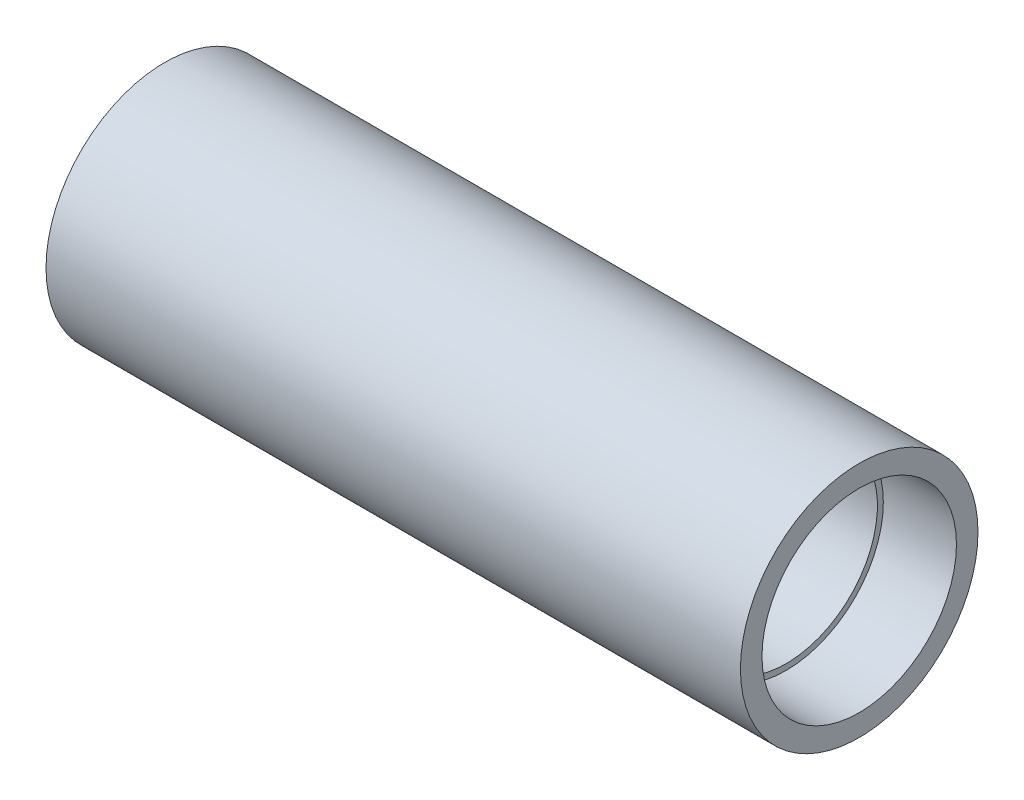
ISO-10303-21;
HEADER;
FILE_DESCRIPTION(('STEP AP214'),'2;1');
FILE_NAME('part.step','',(''),(''),'','','');
FILE_SCHEMA(('AUTOMOTIVE_DESIGN { 1 0 10303 214 1 1 1 1 }'));
ENDSEC;
DATA;
#1=APPLICATION_CONTEXT('core data for automotive mechanical design processes');
#2=APPLICATION_PROTOCOL_DEFINITION('international standard','automotive_design',2000,#1);
#3=PRODUCT_CONTEXT('',#1,'mechanical');
#4=PRODUCT('Part','Part','',(#3));
#5=PRODUCT_RELATED_PRODUCT_CATEGORY('part','',(#4));
#6=PRODUCT_DEFINITION_FORMATION('','',#4);
#7=PRODUCT_DEFINITION_CONTEXT('part definition',#1,'design');
#8=PRODUCT_DEFINITION('design','',#6,#7);
#9=PRODUCT_DEFINITION_SHAPE('','',#8);
#10=(LENGTH_UNIT() NAMED_UNIT(*) SI_UNIT(.MILLI.,.METRE.));
#11=(NAMED_UNIT(*) PLANE_ANGLE_UNIT() SI_UNIT($,.RADIAN.));
#12=(NAMED_UNIT(*) SI_UNIT($,.STERADIAN.) SOLID_ANGLE_UNIT());
#13=UNCERTAINTY_MEASURE_WITH_UNIT(LENGTH_MEASURE(1.E-05),#10,'distance_accuracy_value','');
#14=(GEOMETRIC_REPRESENTATION_CONTEXT(3) GLOBAL_UNCERTAINTY_ASSIGNED_CONTEXT((#13)) GLOBAL_UNIT_ASSIGNED_CONTEXT((#10,
#11,#12)) REPRESENTATION_CONTEXT('',''));
#15=CARTESIAN_POINT('',(0.,0.,0.));
#16=DIRECTION('',(0.,0.,1.));
#17=DIRECTION('',(1.,0.,0.));
#18=AXIS2_PLACEMENT_3D('',#15,#16,#17);
#19=CARTESIAN_POINT('',(47.625,16.891,0.));
#20=DIRECTION('',(-1.,0.,0.));
#21=DIRECTION('',(0.,0.,1.));
#22=AXIS2_PLACEMENT_3D('',#19,#20,#21);
#23=PLANE('',#22);
#24=CARTESIAN_POINT('',(47.625,0.,0.));
#25=DIRECTION('',(-1.,0.,0.));
#26=DIRECTION('',(0.,0.,1.));
#27=AXIS2_PLACEMENT_3D('',#24,#25,#26);
#28=CIRCLE('',#27,16.891);
#29=CARTESIAN_POINT('',(47.625,0.,16.891));
#30=VERTEX_POINT('',#29);
#31=EDGE_CURVE('E58',#30,#30,#28,.T.);
#32=ORIENTED_EDGE('',*,*,#31,.F.);
#33=EDGE_LOOP('',(#32));
#34=FACE_BOUND('',#33,.T.);
#35=CARTESIAN_POINT('',(47.625,0.,0.));
#36=DIRECTION('',(-1.,0.,0.));
#37=DIRECTION('',(0.,0.,1.));
#38=AXIS2_PLACEMENT_3D('',#35,#36,#37);
#39=CIRCLE('',#38,15.8623);
#40=CARTESIAN_POINT('',(47.625,0.,15.8623));
#41=VERTEX_POINT('',#40);
#42=EDGE_CURVE('E10',#41,#41,#39,.T.);
#43=ORIENTED_EDGE('',*,*,#42,.T.);
#44=EDGE_LOOP('',(#43));
#45=FACE_BOUND('',#44,.T.);
#46=ADVANCED_FACE('F30',(#34,#45),#23,.F.);
#47=CARTESIAN_POINT('',(0.,0.,0.));
#48=DIRECTION('',(-1.,0.,0.));
#49=DIRECTION('',(0.,0.,1.));
#50=AXIS2_PLACEMENT_3D('',#47,#48,#49);
#51=CYLINDRICAL_SURFACE('',#50,15.8623);
#52=ORIENTED_EDGE('',*,*,#42,.F.);
#53=EDGE_LOOP('',(#52));
#54=FACE_BOUND('',#53,.T.);
#55=CARTESIAN_POINT('',(-47.625,0.,0.));
#56=DIRECTION('',(-1.,0.,0.));
#57=DIRECTION('',(0.,0.,1.));
#58=AXIS2_PLACEMENT_3D('',#55,#56,#57);
#59=CIRCLE('',#58,15.8623);
#60=CARTESIAN_POINT('',(-47.625,0.,15.8623));
#61=VERTEX_POINT('',#60);
#62=EDGE_CURVE('E36',#61,#61,#59,.T.);
#63=ORIENTED_EDGE('',*,*,#62,.T.);
#64=EDGE_LOOP('',(#63));
#65=FACE_BOUND('',#64,.T.);
#66=ADVANCED_FACE('F65',(#54,#65),#51,.F.);
#67=CARTESIAN_POINT('',(-47.625,15.8623,0.));
#68=DIRECTION('',(1.,0.,0.));
#69=DIRECTION('',(0.,0.,-1.));
#70=AXIS2_PLACEMENT_3D('',#67,#68,#69);
#71=PLANE('',#70);
#72=ORIENTED_EDGE('',*,*,#62,.F.);
#73=EDGE_LOOP('',(#72));
#74=FACE_BOUND('',#73,.T.);
#75=CARTESIAN_POINT('',(-47.625,0.,0.));
#76=DIRECTION('',(-1.,0.,0.));
#77=DIRECTION('',(0.,0.,1.));
#78=AXIS2_PLACEMENT_3D('',#75,#76,#77);
#79=CIRCLE('',#78,16.891);
#80=CARTESIAN_POINT('',(-47.625,0.,16.891));
#81=VERTEX_POINT('',#80);
#82=EDGE_CURVE('E40',#81,#81,#79,.T.);
#83=ORIENTED_EDGE('',*,*,#82,.T.);
#84=EDGE_LOOP('',(#83));
#85=FACE_BOUND('',#84,.T.);
#86=ADVANCED_FACE('F69',(#74,#85),#71,.F.);
#87=CARTESIAN_POINT('',(0.,0.,0.));
#88=DIRECTION('',(-1.,0.,0.));
#89=DIRECTION('',(0.,0.,1.));
#90=AXIS2_PLACEMENT_3D('',#87,#88,#89);
#91=CYLINDRICAL_SURFACE('',#90,16.891);
#92=ORIENTED_EDGE('',*,*,#82,.F.);
#93=EDGE_LOOP('',(#92));
#94=FACE_BOUND('',#93,.T.);
#95=CARTESIAN_POINT('',(-60.325,0.,0.));
#96=DIRECTION('',(-1.,0.,0.));
#97=DIRECTION('',(0.,0.,1.));
#98=AXIS2_PLACEMENT_3D('',#95,#96,#97);
#99=CIRCLE('',#98,16.891);
#100=CARTESIAN_POINT('',(-60.325,0.,16.891));
#101=VERTEX_POINT('',#100);
#102=EDGE_CURVE('E44',#101,#101,#99,.T.);
#103=ORIENTED_EDGE('',*,*,#102,.T.);
#104=EDGE_LOOP('',(#103));
#105=FACE_BOUND('',#104,.T.);
#106=ADVANCED_FACE('F74',(#94,#105),#91,.F.);
#107=CARTESIAN_POINT('',(-60.325,16.891,0.));
#108=DIRECTION('',(1.,0.,0.));
#109=DIRECTION('',(0.,0.,-1.));
#110=AXIS2_PLACEMENT_3D('',#107,#108,#109);
#111=PLANE('',#110);
#112=ORIENTED_EDGE('',*,*,#102,.F.);
#113=EDGE_LOOP('',(#112));
#114=FACE_BOUND('',#113,.T.);
#115=CARTESIAN_POINT('',(-60.325,0.,0.));
#116=DIRECTION('',(-1.,0.,0.));
#117=DIRECTION('',(0.,0.,1.));
#118=AXIS2_PLACEMENT_3D('',#115,#116,#117);
#119=CIRCLE('',#118,20.6375);
#120=CARTESIAN_POINT('',(-60.325,0.,20.6375));
#121=VERTEX_POINT('',#120);
#122=EDGE_CURVE('E49',#121,#121,#119,.T.);
#123=ORIENTED_EDGE('',*,*,#122,.T.);
#124=EDGE_LOOP('',(#123));
#125=FACE_BOUND('',#124,.T.);
#126=ADVANCED_FACE('F80',(#114,#125),#111,.F.);
#127=CARTESIAN_POINT('',(0.,0.,0.));
#128=DIRECTION('',(-1.,0.,0.));
#129=DIRECTION('',(0.,0.,1.));
#130=AXIS2_PLACEMENT_3D('',#127,#128,#129);
#131=CYLINDRICAL_SURFACE('',#130,20.6375);
#132=ORIENTED_EDGE('',*,*,#122,.F.);
#133=EDGE_LOOP('',(#132));
#134=FACE_BOUND('',#133,.T.);
#135=CARTESIAN_POINT('',(60.325,0.,0.));
#136=DIRECTION('',(-1.,0.,0.));
#137=DIRECTION('',(0.,0.,1.));
#138=AXIS2_PLACEMENT_3D('',#135,#136,#137);
#139=CIRCLE('',#138,20.6375);
#140=CARTESIAN_POINT('',(60.325,0.,20.6375));
#141=VERTEX_POINT('',#140);
#142=EDGE_CURVE('E52',#141,#141,#139,.T.);
#143=ORIENTED_EDGE('',*,*,#142,.T.);
#144=EDGE_LOOP('',(#143));
#145=FACE_BOUND('',#144,.T.);
#146=ADVANCED_FACE('F84',(#134,#145),#131,.T.);
#147=CARTESIAN_POINT('',(60.325,20.6375,0.));
#148=DIRECTION('',(-1.,0.,0.));
#149=DIRECTION('',(0.,0.,1.));
#150=AXIS2_PLACEMENT_3D('',#147,#148,#149);
#151=PLANE('',#150);
#152=ORIENTED_EDGE('',*,*,#142,.F.);
#153=EDGE_LOOP('',(#152));
#154=FACE_BOUND('',#153,.T.);
#155=CARTESIAN_POINT('',(60.325,0.,0.));
#156=DIRECTION('',(-1.,0.,0.));
#157=DIRECTION('',(0.,0.,1.));
#158=AXIS2_PLACEMENT_3D('',#155,#156,#157);
#159=CIRCLE('',#158,16.891);
#160=CARTESIAN_POINT('',(60.325,0.,16.891));
#161=VERTEX_POINT('',#160);
#162=EDGE_CURVE('E55',#161,#161,#159,.T.);
#163=ORIENTED_EDGE('',*,*,#162,.T.);
#164=EDGE_LOOP('',(#163));
#165=FACE_BOUND('',#164,.T.);
#166=ADVANCED_FACE('F88',(#154,#165),#151,.F.);
#167=CARTESIAN_POINT('',(0.,0.,0.));
#168=DIRECTION('',(-1.,0.,0.));
#169=DIRECTION('',(0.,0.,1.));
#170=AXIS2_PLACEMENT_3D('',#167,#168,#169);
#171=CYLINDRICAL_SURFACE('',#170,16.891);
#172=ORIENTED_EDGE('',*,*,#162,.F.);
#173=EDGE_LOOP('',(#172));
#174=FACE_BOUND('',#173,.T.);
#175=ORIENTED_EDGE('',*,*,#31,.T.);
#176=EDGE_LOOP('',(#175));
#177=FACE_BOUND('',#176,.T.);
#178=ADVANCED_FACE('F62',(#174,#177),#171,.F.);
#179=CLOSED_SHELL('',(#46,#66,#86,#106,#126,#146,#166,#178));
#180=MANIFOLD_SOLID_BREP('B2',#179);
#181=ADVANCED_BREP_SHAPE_REPRESENTATION('',(#18,#180),#14);
#182=SHAPE_DEFINITION_REPRESENTATION(#9,#181);
ENDSEC;
END-ISO-10303-21;
